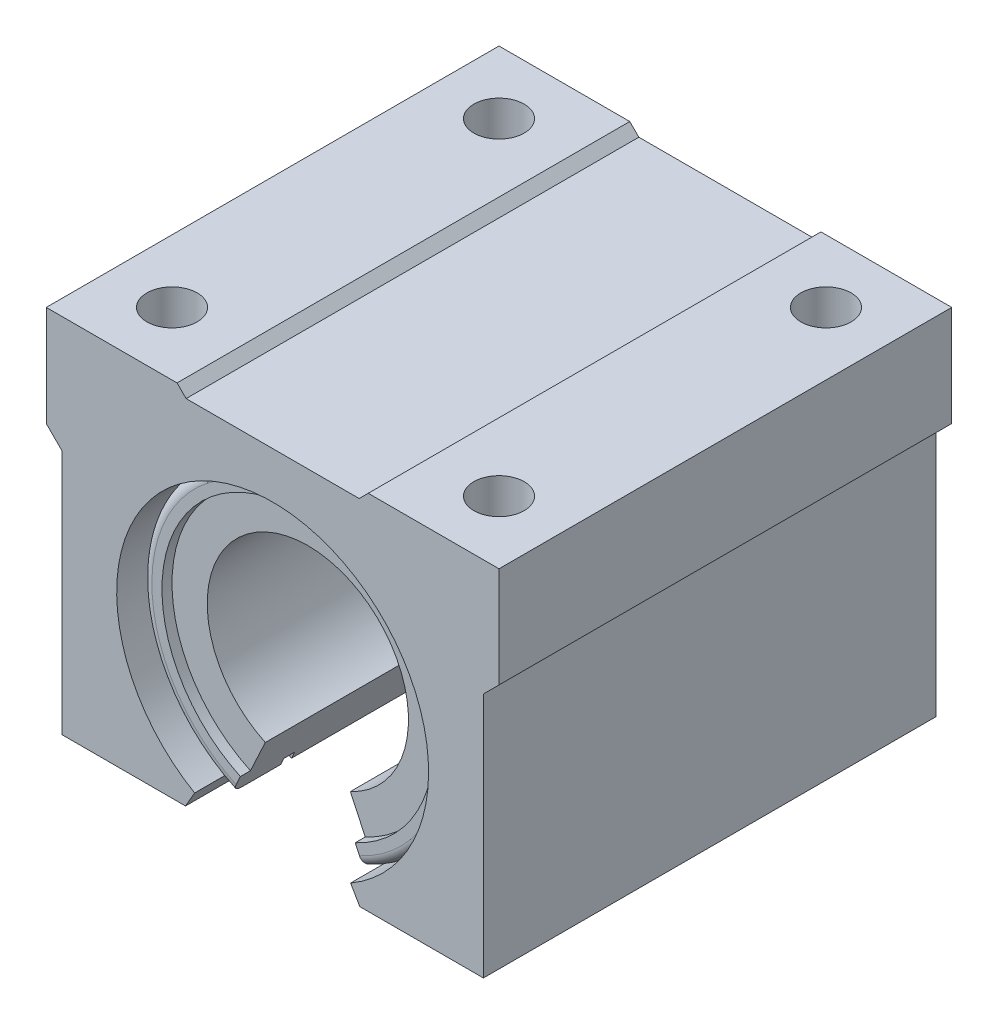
ISO-10303-21;
HEADER;
FILE_DESCRIPTION(('STEP AP214'),'2;1');
FILE_NAME('part.step','',(''),(''),'','','');
FILE_SCHEMA(('AUTOMOTIVE_DESIGN { 1 0 10303 214 1 1 1 1 }'));
ENDSEC;
DATA;
#1=APPLICATION_CONTEXT('core data for automotive mechanical design processes');
#2=APPLICATION_PROTOCOL_DEFINITION('international standard','automotive_design',2000,#1);
#3=PRODUCT_CONTEXT('',#1,'mechanical');
#4=PRODUCT('Part','Part','',(#3));
#5=PRODUCT_RELATED_PRODUCT_CATEGORY('part','',(#4));
#6=PRODUCT_DEFINITION_FORMATION('','',#4);
#7=PRODUCT_DEFINITION_CONTEXT('part definition',#1,'design');
#8=PRODUCT_DEFINITION('design','',#6,#7);
#9=PRODUCT_DEFINITION_SHAPE('','',#8);
#10=(LENGTH_UNIT() NAMED_UNIT(*) SI_UNIT(.MILLI.,.METRE.));
#11=(NAMED_UNIT(*) PLANE_ANGLE_UNIT() SI_UNIT($,.RADIAN.));
#12=(NAMED_UNIT(*) SI_UNIT($,.STERADIAN.) SOLID_ANGLE_UNIT());
#13=UNCERTAINTY_MEASURE_WITH_UNIT(LENGTH_MEASURE(1.E-05),#10,'distance_accuracy_value','');
#14=(GEOMETRIC_REPRESENTATION_CONTEXT(3) GLOBAL_UNCERTAINTY_ASSIGNED_CONTEXT((#13)) GLOBAL_UNIT_ASSIGNED_CONTEXT((#10,
#11,#12)) REPRESENTATION_CONTEXT('',''));
#15=CARTESIAN_POINT('',(0.,0.,0.));
#16=DIRECTION('',(0.,0.,1.));
#17=DIRECTION('',(1.,0.,0.));
#18=AXIS2_PLACEMENT_3D('',#15,#16,#17);
#19=CARTESIAN_POINT('',(0.,0.,40.));
#20=DIRECTION('',(0.,0.,-1.));
#21=DIRECTION('',(-1.,0.,0.));
#22=AXIS2_PLACEMENT_3D('',#19,#20,#21);
#23=CYLINDRICAL_SURFACE('',#22,20.);
#24=DIRECTION('',(0.,0.,-1.));
#25=VECTOR('',#24,1.);
#26=CARTESIAN_POINT('',(8.45236523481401,-18.126155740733,40.));
#27=LINE('',#26,#25);
#28=CARTESIAN_POINT('',(8.45236523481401,-18.126155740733,38.));
#29=VERTEX_POINT('',#28);
#30=CARTESIAN_POINT('',(8.45236523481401,-18.126155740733,-38.));
#31=VERTEX_POINT('',#30);
#32=EDGE_CURVE('P0_E38',#29,#31,#27,.T.);
#33=ORIENTED_EDGE('',*,*,#32,.F.);
#34=CARTESIAN_POINT('',(0.,0.,38.));
#35=DIRECTION('',(0.,0.,1.));
#36=DIRECTION('',(1.,0.,0.));
#37=AXIS2_PLACEMENT_3D('',#34,#35,#36);
#38=CIRCLE('',#37,20.);
#39=CARTESIAN_POINT('',(-8.45236523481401,-18.126155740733,38.));
#40=VERTEX_POINT('',#39);
#41=EDGE_CURVE('P0_E168',#29,#40,#38,.T.);
#42=ORIENTED_EDGE('',*,*,#41,.T.);
#43=DIRECTION('',(0.,0.,-1.));
#44=VECTOR('',#43,1.);
#45=CARTESIAN_POINT('',(-8.45236523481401,-18.126155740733,40.));
#46=LINE('',#45,#44);
#47=CARTESIAN_POINT('',(-8.45236523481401,-18.126155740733,-38.));
#48=VERTEX_POINT('',#47);
#49=EDGE_CURVE('P0_E211',#48,#40,#46,.F.);
#50=ORIENTED_EDGE('',*,*,#49,.F.);
#51=CARTESIAN_POINT('',(0.,0.,-38.));
#52=DIRECTION('',(0.,0.,-1.));
#53=DIRECTION('',(-1.,0.,0.));
#54=AXIS2_PLACEMENT_3D('',#51,#52,#53);
#55=CIRCLE('',#54,20.);
#56=EDGE_CURVE('P0_E166',#48,#31,#55,.T.);
#57=ORIENTED_EDGE('',*,*,#56,.T.);
#58=EDGE_LOOP('',(#33,#42,#50,#57));
#59=FACE_BOUND('',#58,.T.);
#60=ADVANCED_FACE('P0_F16',(#59),#23,.F.);
#61=CARTESIAN_POINT('',(0.,0.,-40.));
#62=DIRECTION('',(0.,0.,1.));
#63=DIRECTION('',(1.,0.,0.));
#64=AXIS2_PLACEMENT_3D('',#61,#62,#63);
#65=PLANE('',#64);
#66=CARTESIAN_POINT('',(0.,0.,-40.));
#67=DIRECTION('',(0.,0.,1.));
#68=DIRECTION('',(1.,0.,0.));
#69=AXIS2_PLACEMENT_3D('',#66,#67,#68);
#70=CIRCLE('',#69,29.);
#71=CARTESIAN_POINT('',(-12.2559295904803,-26.2829258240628,-40.));
#72=VERTEX_POINT('',#71);
#73=CARTESIAN_POINT('',(12.2559295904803,-26.2829258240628,-40.));
#74=VERTEX_POINT('',#73);
#75=EDGE_CURVE('P0_E202',#72,#74,#70,.F.);
#76=ORIENTED_EDGE('',*,*,#75,.T.);
#77=DIRECTION('',(-0.4226182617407,0.90630778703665,0.));
#78=VECTOR('',#77,1.);
#79=CARTESIAN_POINT('',(0.,0.,-40.));
#80=LINE('',#79,#78);
#81=CARTESIAN_POINT('',(11.4106930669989,-24.4703102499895,-40.));
#82=VERTEX_POINT('',#81);
#83=EDGE_CURVE('P0_E159',#74,#82,#80,.T.);
#84=ORIENTED_EDGE('',*,*,#83,.T.);
#85=CARTESIAN_POINT('',(0.,0.,-40.));
#86=DIRECTION('',(0.,0.,1.));
#87=DIRECTION('',(1.,0.,0.));
#88=AXIS2_PLACEMENT_3D('',#85,#86,#87);
#89=CIRCLE('',#88,27.);
#90=CARTESIAN_POINT('',(-11.4106930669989,-24.4703102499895,-40.));
#91=VERTEX_POINT('',#90);
#92=EDGE_CURVE('P0_E228',#82,#91,#89,.T.);
#93=ORIENTED_EDGE('',*,*,#92,.T.);
#94=DIRECTION('',(-0.4226182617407,-0.90630778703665,0.));
#95=VECTOR('',#94,1.);
#96=CARTESIAN_POINT('',(0.,0.,-40.));
#97=LINE('',#96,#95);
#98=EDGE_CURVE('P0_E258',#91,#72,#97,.T.);
#99=ORIENTED_EDGE('',*,*,#98,.T.);
#100=EDGE_LOOP('',(#76,#84,#93,#99));
#101=FACE_BOUND('',#100,.T.);
#102=ADVANCED_FACE('P0_F257',(#101),#65,.F.);
#103=CARTESIAN_POINT('',(0.,0.,40.));
#104=DIRECTION('',(0.,0.,-1.));
#105=DIRECTION('',(-1.,0.,0.));
#106=AXIS2_PLACEMENT_3D('',#103,#104,#105);
#107=CYLINDRICAL_SURFACE('',#106,31.);
#108=CARTESIAN_POINT('',(0.,0.,28.15));
#109=DIRECTION('',(0.,0.,1.));
#110=DIRECTION('',(1.,0.,0.));
#111=AXIS2_PLACEMENT_3D('',#108,#109,#110);
#112=CIRCLE('',#111,31.);
#113=CARTESIAN_POINT('',(13.1011661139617,-28.0955413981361,28.15));
#114=VERTEX_POINT('',#113);
#115=CARTESIAN_POINT('',(-13.1011661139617,-28.0955413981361,28.15));
#116=VERTEX_POINT('',#115);
#117=EDGE_CURVE('P0_E187',#114,#116,#112,.T.);
#118=ORIENTED_EDGE('',*,*,#117,.F.);
#119=DIRECTION('',(0.,0.,1.));
#120=VECTOR('',#119,1.);
#121=CARTESIAN_POINT('',(13.1011661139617,-28.0955413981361,-40.));
#122=LINE('',#121,#120);
#123=CARTESIAN_POINT('',(13.1011661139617,-28.0955413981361,-28.15));
#124=VERTEX_POINT('',#123);
#125=EDGE_CURVE('P0_E268',#124,#114,#122,.T.);
#126=ORIENTED_EDGE('',*,*,#125,.F.);
#127=CARTESIAN_POINT('',(0.,0.,-28.15));
#128=DIRECTION('',(0.,0.,1.));
#129=DIRECTION('',(1.,0.,0.));
#130=AXIS2_PLACEMENT_3D('',#127,#128,#129);
#131=CIRCLE('',#130,31.);
#132=CARTESIAN_POINT('',(-13.1011661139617,-28.0955413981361,-28.15));
#133=VERTEX_POINT('',#132);
#134=EDGE_CURVE('P0_E184',#124,#133,#131,.T.);
#135=ORIENTED_EDGE('',*,*,#134,.T.);
#136=DIRECTION('',(0.,0.,1.));
#137=VECTOR('',#136,1.);
#138=CARTESIAN_POINT('',(-13.1011661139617,-28.0955413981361,-40.));
#139=LINE('',#138,#137);
#140=EDGE_CURVE('P0_E273',#133,#116,#139,.T.);
#141=ORIENTED_EDGE('',*,*,#140,.T.);
#142=EDGE_LOOP('',(#118,#126,#135,#141));
#143=FACE_BOUND('',#142,.T.);
#144=ADVANCED_FACE('P0_F325',(#143),#107,.T.);
#145=CARTESIAN_POINT('',(0.,0.,-30.3));
#146=DIRECTION('',(0.,0.,1.));
#147=DIRECTION('',(1.,0.,0.));
#148=AXIS2_PLACEMENT_3D('',#145,#146,#147);
#149=CIRCLE('',#148,31.);
#150=CARTESIAN_POINT('',(13.1011661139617,-28.0955413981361,-30.3));
#151=VERTEX_POINT('',#150);
#152=CARTESIAN_POINT('',(-13.1011661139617,-28.0955413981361,-30.3));
#153=VERTEX_POINT('',#152);
#154=EDGE_CURVE('P0_E181',#151,#153,#149,.T.);
#155=ORIENTED_EDGE('',*,*,#154,.F.);
#156=CARTESIAN_POINT('',(13.1011661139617,-28.0955413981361,-38.));
#157=VERTEX_POINT('',#156);
#158=EDGE_CURVE('P0_E270',#157,#151,#122,.T.);
#159=ORIENTED_EDGE('',*,*,#158,.F.);
#160=CARTESIAN_POINT('',(0.,0.,-38.));
#161=DIRECTION('',(0.,0.,1.));
#162=DIRECTION('',(1.,0.,0.));
#163=AXIS2_PLACEMENT_3D('',#160,#161,#162);
#164=CIRCLE('',#163,31.);
#165=CARTESIAN_POINT('',(-13.1011661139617,-28.0955413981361,-38.));
#166=VERTEX_POINT('',#165);
#167=EDGE_CURVE('P0_E199',#157,#166,#164,.T.);
#168=ORIENTED_EDGE('',*,*,#167,.T.);
#169=EDGE_CURVE('P0_E269',#166,#153,#139,.T.);
#170=ORIENTED_EDGE('',*,*,#169,.T.);
#171=EDGE_LOOP('',(#155,#159,#168,#170));
#172=FACE_BOUND('',#171,.T.);
#173=ADVANCED_FACE('P0_F333',(#172),#107,.T.);
#174=CARTESIAN_POINT('',(0.,0.,38.));
#175=DIRECTION('',(0.,0.,1.));
#176=DIRECTION('',(1.,0.,0.));
#177=AXIS2_PLACEMENT_3D('',#174,#175,#176);
#178=CIRCLE('',#177,31.);
#179=CARTESIAN_POINT('',(-13.1011661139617,-28.0955413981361,38.));
#180=VERTEX_POINT('',#179);
#181=CARTESIAN_POINT('',(13.1011661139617,-28.0955413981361,38.));
#182=VERTEX_POINT('',#181);
#183=EDGE_CURVE('P0_E206',#180,#182,#178,.F.);
#184=ORIENTED_EDGE('',*,*,#183,.T.);
#185=CARTESIAN_POINT('',(13.1011661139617,-28.0955413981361,30.3));
#186=VERTEX_POINT('',#185);
#187=EDGE_CURVE('P0_E266',#186,#182,#122,.T.);
#188=ORIENTED_EDGE('',*,*,#187,.F.);
#189=CARTESIAN_POINT('',(0.,0.,30.3));
#190=DIRECTION('',(0.,0.,1.));
#191=DIRECTION('',(1.,0.,0.));
#192=AXIS2_PLACEMENT_3D('',#189,#190,#191);
#193=CIRCLE('',#192,31.);
#194=CARTESIAN_POINT('',(-13.1011661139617,-28.0955413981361,30.3));
#195=VERTEX_POINT('',#194);
#196=EDGE_CURVE('P0_E196',#186,#195,#193,.T.);
#197=ORIENTED_EDGE('',*,*,#196,.T.);
#198=EDGE_CURVE('P0_E262',#195,#180,#139,.T.);
#199=ORIENTED_EDGE('',*,*,#198,.T.);
#200=EDGE_LOOP('',(#184,#188,#197,#199));
#201=FACE_BOUND('',#200,.T.);
#202=ADVANCED_FACE('P0_F305',(#201),#107,.T.);
#203=CARTESIAN_POINT('',(0.,0.,40.));
#204=DIRECTION('',(0.,0.,1.));
#205=DIRECTION('',(1.,0.,0.));
#206=AXIS2_PLACEMENT_3D('',#203,#204,#205);
#207=PLANE('',#206);
#208=DIRECTION('',(-0.4226182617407,0.90630778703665,0.));
#209=VECTOR('',#208,1.);
#210=CARTESIAN_POINT('',(0.,0.,40.));
#211=LINE('',#210,#209);
#212=CARTESIAN_POINT('',(12.2559295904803,-26.2829258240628,40.));
#213=VERTEX_POINT('',#212);
#214=CARTESIAN_POINT('',(11.4106930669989,-24.4703102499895,40.));
#215=VERTEX_POINT('',#214);
#216=EDGE_CURVE('P0_E160',#213,#215,#211,.T.);
#217=ORIENTED_EDGE('',*,*,#216,.F.);
#218=CARTESIAN_POINT('',(0.,0.,40.));
#219=DIRECTION('',(0.,0.,1.));
#220=DIRECTION('',(1.,0.,0.));
#221=AXIS2_PLACEMENT_3D('',#218,#219,#220);
#222=CIRCLE('',#221,29.);
#223=CARTESIAN_POINT('',(-12.2559295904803,-26.2829258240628,40.));
#224=VERTEX_POINT('',#223);
#225=EDGE_CURVE('P0_E158',#213,#224,#222,.T.);
#226=ORIENTED_EDGE('',*,*,#225,.T.);
#227=DIRECTION('',(-0.4226182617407,-0.90630778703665,0.));
#228=VECTOR('',#227,1.);
#229=CARTESIAN_POINT('',(0.,0.,40.));
#230=LINE('',#229,#228);
#231=CARTESIAN_POINT('',(-11.4106930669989,-24.4703102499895,40.));
#232=VERTEX_POINT('',#231);
#233=EDGE_CURVE('P0_E141',#232,#224,#230,.T.);
#234=ORIENTED_EDGE('',*,*,#233,.F.);
#235=CARTESIAN_POINT('',(0.,0.,40.));
#236=DIRECTION('',(0.,0.,1.));
#237=DIRECTION('',(1.,0.,0.));
#238=AXIS2_PLACEMENT_3D('',#235,#236,#237);
#239=CIRCLE('',#238,27.);
#240=EDGE_CURVE('P0_E156',#215,#232,#239,.T.);
#241=ORIENTED_EDGE('',*,*,#240,.F.);
#242=EDGE_LOOP('',(#217,#226,#234,#241));
#243=FACE_BOUND('',#242,.T.);
#244=ADVANCED_FACE('P0_F155',(#243),#207,.T.);
#245=CARTESIAN_POINT('',(-2.16471843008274E-13,-31.,30.3));
#246=DIRECTION('',(0.,0.,-1.));
#247=DIRECTION('',(-1.,0.,0.));
#248=AXIS2_PLACEMENT_3D('',#245,#246,#247);
#249=PLANE('',#248);
#250=DIRECTION('',(0.4226182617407,-0.90630778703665,0.));
#251=VECTOR('',#250,1.);
#252=CARTESIAN_POINT('',(11.8736888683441,-25.4632079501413,30.3));
#253=LINE('',#252,#251);
#254=CARTESIAN_POINT('',(12.4672387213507,-26.7360797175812,30.3));
#255=VERTEX_POINT('',#254);
#256=EDGE_CURVE('P0_E253',#255,#186,#253,.T.);
#257=ORIENTED_EDGE('',*,*,#256,.F.);
#258=CARTESIAN_POINT('',(0.,0.,30.3));
#259=DIRECTION('',(0.,0.,1.));
#260=DIRECTION('',(1.,0.,0.));
#261=AXIS2_PLACEMENT_3D('',#258,#259,#260);
#262=CIRCLE('',#261,29.5);
#263=CARTESIAN_POINT('',(-12.4672387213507,-26.7360797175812,30.3));
#264=VERTEX_POINT('',#263);
#265=EDGE_CURVE('P0_E193',#255,#264,#262,.T.);
#266=ORIENTED_EDGE('',*,*,#265,.T.);
#267=DIRECTION('',(0.4226182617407,0.90630778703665,0.));
#268=VECTOR('',#267,1.);
#269=CARTESIAN_POINT('',(-11.8736888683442,-25.4632079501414,30.3));
#270=LINE('',#269,#268);
#271=EDGE_CURVE('P0_E229',#195,#264,#270,.T.);
#272=ORIENTED_EDGE('',*,*,#271,.F.);
#273=ORIENTED_EDGE('',*,*,#196,.F.);
#274=EDGE_LOOP('',(#257,#266,#272,#273));
#275=FACE_BOUND('',#274,.T.);
#276=ADVANCED_FACE('P0_F303',(#275),#249,.T.);
#277=CARTESIAN_POINT('',(0.,0.,0.));
#278=DIRECTION('',(0.,0.,1.));
#279=DIRECTION('',(1.,0.,0.));
#280=AXIS2_PLACEMENT_3D('',#277,#278,#279);
#281=CYLINDRICAL_SURFACE('',#280,29.5);
#282=DIRECTION('',(0.,0.,1.));
#283=VECTOR('',#282,1.);
#284=CARTESIAN_POINT('',(12.4672387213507,-26.7360797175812,0.));
#285=LINE('',#284,#283);
#286=CARTESIAN_POINT('',(12.4672387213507,-26.7360797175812,28.15));
#287=VERTEX_POINT('',#286);
#288=EDGE_CURVE('P0_E251',#287,#255,#285,.T.);
#289=ORIENTED_EDGE('',*,*,#288,.F.);
#290=CARTESIAN_POINT('',(0.,0.,28.15));
#291=DIRECTION('',(0.,0.,1.));
#292=DIRECTION('',(1.,0.,0.));
#293=AXIS2_PLACEMENT_3D('',#290,#291,#292);
#294=CIRCLE('',#293,29.5);
#295=CARTESIAN_POINT('',(-12.4672387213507,-26.7360797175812,28.15));
#296=VERTEX_POINT('',#295);
#297=EDGE_CURVE('P0_E190',#287,#296,#294,.T.);
#298=ORIENTED_EDGE('',*,*,#297,.T.);
#299=DIRECTION('',(0.,0.,1.));
#300=VECTOR('',#299,1.);
#301=CARTESIAN_POINT('',(-12.4672387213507,-26.7360797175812,0.));
#302=LINE('',#301,#300);
#303=EDGE_CURVE('P0_E233',#264,#296,#302,.F.);
#304=ORIENTED_EDGE('',*,*,#303,.F.);
#305=ORIENTED_EDGE('',*,*,#265,.F.);
#306=EDGE_LOOP('',(#289,#298,#304,#305));
#307=FACE_BOUND('',#306,.T.);
#308=ADVANCED_FACE('P0_F298',(#307),#281,.T.);
#309=CARTESIAN_POINT('',(-2.05997398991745E-13,-29.5,28.15));
#310=DIRECTION('',(0.,0.,1.));
#311=DIRECTION('',(1.,0.,0.));
#312=AXIS2_PLACEMENT_3D('',#309,#310,#311);
#313=PLANE('',#312);
#314=DIRECTION('',(-0.4226182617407,0.90630778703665,0.));
#315=VECTOR('',#314,1.);
#316=CARTESIAN_POINT('',(11.2991555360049,-24.2311172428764,28.15));
#317=LINE('',#316,#315);
#318=EDGE_CURVE('P0_E249',#114,#287,#317,.T.);
#319=ORIENTED_EDGE('',*,*,#318,.F.);
#320=ORIENTED_EDGE('',*,*,#117,.T.);
#321=DIRECTION('',(-0.4226182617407,-0.90630778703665,0.));
#322=VECTOR('',#321,1.);
#323=CARTESIAN_POINT('',(-11.299155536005,-24.2311172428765,28.15));
#324=LINE('',#323,#322);
#325=EDGE_CURVE('P0_E285',#296,#116,#324,.T.);
#326=ORIENTED_EDGE('',*,*,#325,.F.);
#327=ORIENTED_EDGE('',*,*,#297,.F.);
#328=EDGE_LOOP('',(#319,#320,#326,#327));
#329=FACE_BOUND('',#328,.T.);
#330=ADVANCED_FACE('P0_F295',(#329),#313,.T.);
#331=CARTESIAN_POINT('',(-2.05997398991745E-13,-29.5,-28.15));
#332=DIRECTION('',(0.,0.,-1.));
#333=DIRECTION('',(-1.,0.,0.));
#334=AXIS2_PLACEMENT_3D('',#331,#332,#333);
#335=PLANE('',#334);
#336=DIRECTION('',(0.4226182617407,-0.90630778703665,0.));
#337=VECTOR('',#336,1.);
#338=CARTESIAN_POINT('',(11.2991555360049,-24.2311172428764,-28.15));
#339=LINE('',#338,#337);
#340=CARTESIAN_POINT('',(12.4672387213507,-26.7360797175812,-28.15));
#341=VERTEX_POINT('',#340);
#342=EDGE_CURVE('P0_E247',#341,#124,#339,.T.);
#343=ORIENTED_EDGE('',*,*,#342,.F.);
#344=CARTESIAN_POINT('',(0.,0.,-28.15));
#345=DIRECTION('',(0.,0.,1.));
#346=DIRECTION('',(1.,0.,0.));
#347=AXIS2_PLACEMENT_3D('',#344,#345,#346);
#348=CIRCLE('',#347,29.5);
#349=CARTESIAN_POINT('',(-12.4672387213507,-26.7360797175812,-28.15));
#350=VERTEX_POINT('',#349);
#351=EDGE_CURVE('P0_E175',#341,#350,#348,.T.);
#352=ORIENTED_EDGE('',*,*,#351,.T.);
#353=DIRECTION('',(0.4226182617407,0.90630778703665,0.));
#354=VECTOR('',#353,1.);
#355=CARTESIAN_POINT('',(-11.299155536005,-24.2311172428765,-28.15));
#356=LINE('',#355,#354);
#357=EDGE_CURVE('P0_E283',#133,#350,#356,.T.);
#358=ORIENTED_EDGE('',*,*,#357,.F.);
#359=ORIENTED_EDGE('',*,*,#134,.F.);
#360=EDGE_LOOP('',(#343,#352,#358,#359));
#361=FACE_BOUND('',#360,.T.);
#362=ADVANCED_FACE('P0_F361',(#361),#335,.T.);
#363=CARTESIAN_POINT('',(-2.16471843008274E-13,-31.,-30.3));
#364=DIRECTION('',(0.,0.,1.));
#365=DIRECTION('',(1.,0.,0.));
#366=AXIS2_PLACEMENT_3D('',#363,#364,#365);
#367=PLANE('',#366);
#368=DIRECTION('',(-0.4226182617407,0.90630778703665,0.));
#369=VECTOR('',#368,1.);
#370=CARTESIAN_POINT('',(11.8736888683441,-25.4632079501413,-30.3));
#371=LINE('',#370,#369);
#372=CARTESIAN_POINT('',(12.4672387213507,-26.7360797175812,-30.3));
#373=VERTEX_POINT('',#372);
#374=EDGE_CURVE('P0_E245',#151,#373,#371,.T.);
#375=ORIENTED_EDGE('',*,*,#374,.F.);
#376=ORIENTED_EDGE('',*,*,#154,.T.);
#377=DIRECTION('',(-0.4226182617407,-0.90630778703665,0.));
#378=VECTOR('',#377,1.);
#379=CARTESIAN_POINT('',(-11.8736888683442,-25.4632079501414,-30.3));
#380=LINE('',#379,#378);
#381=CARTESIAN_POINT('',(-12.4672387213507,-26.7360797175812,-30.3));
#382=VERTEX_POINT('',#381);
#383=EDGE_CURVE('P0_E281',#382,#153,#380,.T.);
#384=ORIENTED_EDGE('',*,*,#383,.F.);
#385=CARTESIAN_POINT('',(0.,0.,-30.3));
#386=DIRECTION('',(0.,0.,1.));
#387=DIRECTION('',(1.,0.,0.));
#388=AXIS2_PLACEMENT_3D('',#385,#386,#387);
#389=CIRCLE('',#388,29.5);
#390=EDGE_CURVE('P0_E178',#373,#382,#389,.T.);
#391=ORIENTED_EDGE('',*,*,#390,.F.);
#392=EDGE_LOOP('',(#375,#376,#384,#391));
#393=FACE_BOUND('',#392,.T.);
#394=ADVANCED_FACE('P0_F353',(#393),#367,.T.);
#395=CARTESIAN_POINT('',(0.,0.,0.));
#396=DIRECTION('',(0.,0.,1.));
#397=DIRECTION('',(1.,0.,0.));
#398=AXIS2_PLACEMENT_3D('',#395,#396,#397);
#399=CYLINDRICAL_SURFACE('',#398,29.5);
#400=DIRECTION('',(0.,0.,1.));
#401=VECTOR('',#400,1.);
#402=CARTESIAN_POINT('',(12.4672387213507,-26.7360797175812,0.));
#403=LINE('',#402,#401);
#404=EDGE_CURVE('P0_E243',#373,#341,#403,.T.);
#405=ORIENTED_EDGE('',*,*,#404,.F.);
#406=ORIENTED_EDGE('',*,*,#390,.T.);
#407=DIRECTION('',(0.,0.,1.));
#408=VECTOR('',#407,1.);
#409=CARTESIAN_POINT('',(-12.4672387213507,-26.7360797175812,0.));
#410=LINE('',#409,#408);
#411=EDGE_CURVE('P0_E279',#350,#382,#410,.F.);
#412=ORIENTED_EDGE('',*,*,#411,.F.);
#413=ORIENTED_EDGE('',*,*,#351,.F.);
#414=EDGE_LOOP('',(#405,#406,#412,#413));
#415=FACE_BOUND('',#414,.T.);
#416=ADVANCED_FACE('P0_F318',(#415),#399,.T.);
#417=CARTESIAN_POINT('',(0.,0.,-38.));
#418=DIRECTION('',(0.,0.,1.));
#419=DIRECTION('',(1.,0.,0.));
#420=AXIS2_PLACEMENT_3D('',#417,#418,#419);
#421=TOROIDAL_SURFACE('',#420,29.,2.);
#422=CARTESIAN_POINT('',(12.2559295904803,-26.2829258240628,-38.));
#423=DIRECTION('',(0.90630778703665,0.4226182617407,0.));
#424=DIRECTION('',(-0.4226182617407,0.90630778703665,0.));
#425=AXIS2_PLACEMENT_3D('',#422,#423,#424);
#426=CIRCLE('',#425,2.);
#427=EDGE_CURVE('P0_E241',#74,#157,#426,.F.);
#428=ORIENTED_EDGE('',*,*,#427,.F.);
#429=ORIENTED_EDGE('',*,*,#75,.F.);
#430=CARTESIAN_POINT('',(-12.2559295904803,-26.2829258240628,-38.));
#431=DIRECTION('',(-0.90630778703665,0.4226182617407,0.));
#432=DIRECTION('',(-0.4226182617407,-0.90630778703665,0.));
#433=AXIS2_PLACEMENT_3D('',#430,#431,#432);
#434=CIRCLE('',#433,2.);
#435=EDGE_CURVE('P0_E277',#166,#72,#434,.F.);
#436=ORIENTED_EDGE('',*,*,#435,.F.);
#437=ORIENTED_EDGE('',*,*,#167,.F.);
#438=EDGE_LOOP('',(#428,#429,#436,#437));
#439=FACE_BOUND('',#438,.T.);
#440=ADVANCED_FACE('P0_F310',(#439),#421,.T.);
#441=CARTESIAN_POINT('',(0.,0.,38.));
#442=DIRECTION('',(0.,0.,1.));
#443=DIRECTION('',(1.,0.,0.));
#444=AXIS2_PLACEMENT_3D('',#441,#442,#443);
#445=TOROIDAL_SURFACE('',#444,29.,2.);
#446=CARTESIAN_POINT('',(12.2559295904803,-26.2829258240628,38.));
#447=DIRECTION('',(0.90630778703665,0.4226182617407,0.));
#448=DIRECTION('',(-0.4226182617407,0.90630778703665,0.));
#449=AXIS2_PLACEMENT_3D('',#446,#447,#448);
#450=CIRCLE('',#449,2.);
#451=EDGE_CURVE('P0_E239',#182,#213,#450,.F.);
#452=ORIENTED_EDGE('',*,*,#451,.F.);
#453=ORIENTED_EDGE('',*,*,#183,.F.);
#454=CARTESIAN_POINT('',(-12.2559295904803,-26.2829258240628,38.));
#455=DIRECTION('',(-0.90630778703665,0.4226182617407,0.));
#456=DIRECTION('',(-0.4226182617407,-0.90630778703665,0.));
#457=AXIS2_PLACEMENT_3D('',#454,#455,#456);
#458=CIRCLE('',#457,2.);
#459=EDGE_CURVE('P0_E149',#224,#180,#458,.F.);
#460=ORIENTED_EDGE('',*,*,#459,.F.);
#461=ORIENTED_EDGE('',*,*,#225,.F.);
#462=EDGE_LOOP('',(#452,#453,#460,#461));
#463=FACE_BOUND('',#462,.T.);
#464=ADVANCED_FACE('P0_F18',(#463),#445,.T.);
#465=CARTESIAN_POINT('',(0.,0.,38.));
#466=DIRECTION('',(0.,0.,1.));
#467=DIRECTION('',(1.,0.,0.));
#468=AXIS2_PLACEMENT_3D('',#465,#466,#467);
#469=CYLINDRICAL_SURFACE('',#468,27.);
#470=CARTESIAN_POINT('',(0.,0.,38.));
#471=DIRECTION('',(0.,0.,1.));
#472=DIRECTION('',(1.,0.,0.));
#473=AXIS2_PLACEMENT_3D('',#470,#471,#472);
#474=CIRCLE('',#473,27.);
#475=CARTESIAN_POINT('',(11.4106930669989,-24.4703102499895,38.));
#476=VERTEX_POINT('',#475);
#477=CARTESIAN_POINT('',(-11.4106930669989,-24.4703102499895,38.));
#478=VERTEX_POINT('',#477);
#479=EDGE_CURVE('P0_E165',#476,#478,#474,.T.);
#480=ORIENTED_EDGE('',*,*,#479,.F.);
#481=DIRECTION('',(0.,0.,1.));
#482=VECTOR('',#481,1.);
#483=CARTESIAN_POINT('',(11.4106930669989,-24.4703102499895,38.));
#484=LINE('',#483,#482);
#485=EDGE_CURVE('P0_E164',#476,#215,#484,.T.);
#486=ORIENTED_EDGE('',*,*,#485,.T.);
#487=ORIENTED_EDGE('',*,*,#240,.T.);
#488=DIRECTION('',(0.,0.,1.));
#489=VECTOR('',#488,1.);
#490=CARTESIAN_POINT('',(-11.4106930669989,-24.4703102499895,38.));
#491=LINE('',#490,#489);
#492=EDGE_CURVE('P0_E138',#232,#478,#491,.F.);
#493=ORIENTED_EDGE('',*,*,#492,.T.);
#494=EDGE_LOOP('',(#480,#486,#487,#493));
#495=FACE_BOUND('',#494,.T.);
#496=ADVANCED_FACE('P0_F163',(#495),#469,.F.);
#497=CARTESIAN_POINT('',(0.,0.,38.));
#498=DIRECTION('',(0.,0.,1.));
#499=DIRECTION('',(1.,0.,0.));
#500=AXIS2_PLACEMENT_3D('',#497,#498,#499);
#501=PLANE('',#500);
#502=DIRECTION('',(-0.4226182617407,0.90630778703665,0.));
#503=VECTOR('',#502,1.);
#504=CARTESIAN_POINT('',(0.,0.,38.));
#505=LINE('',#504,#503);
#506=EDGE_CURVE('P0_E231',#476,#29,#505,.T.);
#507=ORIENTED_EDGE('',*,*,#506,.F.);
#508=ORIENTED_EDGE('',*,*,#479,.T.);
#509=DIRECTION('',(-0.4226182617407,-0.90630778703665,0.));
#510=VECTOR('',#509,1.);
#511=CARTESIAN_POINT('',(0.,0.,38.));
#512=LINE('',#511,#510);
#513=EDGE_CURVE('P0_E144',#40,#478,#512,.T.);
#514=ORIENTED_EDGE('',*,*,#513,.F.);
#515=ORIENTED_EDGE('',*,*,#41,.F.);
#516=EDGE_LOOP('',(#507,#508,#514,#515));
#517=FACE_BOUND('',#516,.T.);
#518=ADVANCED_FACE('P0_F316',(#517),#501,.T.);
#519=CARTESIAN_POINT('',(0.,0.,-38.));
#520=DIRECTION('',(0.,0.,-1.));
#521=DIRECTION('',(-1.,0.,0.));
#522=AXIS2_PLACEMENT_3D('',#519,#520,#521);
#523=CYLINDRICAL_SURFACE('',#522,27.);
#524=DIRECTION('',(0.,0.,-1.));
#525=VECTOR('',#524,1.);
#526=CARTESIAN_POINT('',(11.4106930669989,-24.4703102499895,-38.));
#527=LINE('',#526,#525);
#528=CARTESIAN_POINT('',(11.4106930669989,-24.4703102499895,-38.));
#529=VERTEX_POINT('',#528);
#530=EDGE_CURVE('P0_E222',#529,#82,#527,.T.);
#531=ORIENTED_EDGE('',*,*,#530,.F.);
#532=CARTESIAN_POINT('',(0.,0.,-38.));
#533=DIRECTION('',(0.,0.,1.));
#534=DIRECTION('',(1.,0.,0.));
#535=AXIS2_PLACEMENT_3D('',#532,#533,#534);
#536=CIRCLE('',#535,27.);
#537=CARTESIAN_POINT('',(-11.4106930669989,-24.4703102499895,-38.));
#538=VERTEX_POINT('',#537);
#539=EDGE_CURVE('P0_E171',#529,#538,#536,.T.);
#540=ORIENTED_EDGE('',*,*,#539,.T.);
#541=DIRECTION('',(0.,0.,-1.));
#542=VECTOR('',#541,1.);
#543=CARTESIAN_POINT('',(-11.4106930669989,-24.4703102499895,-38.));
#544=LINE('',#543,#542);
#545=EDGE_CURVE('P0_E31',#91,#538,#544,.F.);
#546=ORIENTED_EDGE('',*,*,#545,.F.);
#547=ORIENTED_EDGE('',*,*,#92,.F.);
#548=EDGE_LOOP('',(#531,#540,#546,#547));
#549=FACE_BOUND('',#548,.T.);
#550=ADVANCED_FACE('P0_F226',(#549),#523,.F.);
#551=CARTESIAN_POINT('',(0.,0.,-38.));
#552=DIRECTION('',(0.,0.,-1.));
#553=DIRECTION('',(1.,0.,0.));
#554=AXIS2_PLACEMENT_3D('',#551,#552,#553);
#555=PLANE('',#554);
#556=DIRECTION('',(0.4226182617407,-0.90630778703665,0.));
#557=VECTOR('',#556,1.);
#558=CARTESIAN_POINT('',(0.,0.,-38.));
#559=LINE('',#558,#557);
#560=EDGE_CURVE('P0_E11',#31,#529,#559,.T.);
#561=ORIENTED_EDGE('',*,*,#560,.F.);
#562=ORIENTED_EDGE('',*,*,#56,.F.);
#563=DIRECTION('',(0.4226182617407,0.90630778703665,0.));
#564=VECTOR('',#563,1.);
#565=CARTESIAN_POINT('',(0.,0.,-38.));
#566=LINE('',#565,#564);
#567=EDGE_CURVE('P0_E24',#538,#48,#566,.T.);
#568=ORIENTED_EDGE('',*,*,#567,.F.);
#569=ORIENTED_EDGE('',*,*,#539,.F.);
#570=EDGE_LOOP('',(#561,#562,#568,#569));
#571=FACE_BOUND('',#570,.T.);
#572=ADVANCED_FACE('P0_F219',(#571),#555,.T.);
#573=CARTESIAN_POINT('',(0.,0.,-40.));
#574=DIRECTION('',(-0.90630778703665,0.4226182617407,0.));
#575=DIRECTION('',(-0.4226182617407,-0.90630778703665,0.));
#576=AXIS2_PLACEMENT_3D('',#573,#574,#575);
#577=PLANE('',#576);
#578=ORIENTED_EDGE('',*,*,#271,.T.);
#579=ORIENTED_EDGE('',*,*,#303,.T.);
#580=ORIENTED_EDGE('',*,*,#325,.T.);
#581=ORIENTED_EDGE('',*,*,#140,.F.);
#582=ORIENTED_EDGE('',*,*,#357,.T.);
#583=ORIENTED_EDGE('',*,*,#411,.T.);
#584=ORIENTED_EDGE('',*,*,#383,.T.);
#585=ORIENTED_EDGE('',*,*,#169,.F.);
#586=ORIENTED_EDGE('',*,*,#435,.T.);
#587=ORIENTED_EDGE('',*,*,#98,.F.);
#588=ORIENTED_EDGE('',*,*,#545,.T.);
#589=ORIENTED_EDGE('',*,*,#567,.T.);
#590=ORIENTED_EDGE('',*,*,#49,.T.);
#591=ORIENTED_EDGE('',*,*,#513,.T.);
#592=ORIENTED_EDGE('',*,*,#492,.F.);
#593=ORIENTED_EDGE('',*,*,#233,.T.);
#594=ORIENTED_EDGE('',*,*,#459,.T.);
#595=ORIENTED_EDGE('',*,*,#198,.F.);
#596=EDGE_LOOP('',(#578,#579,#580,#581,#582,#583,#584,#585,#586,#587,#588,#589,#590,#591,#592,
#593,#594,#595));
#597=FACE_BOUND('',#596,.T.);
#598=ADVANCED_FACE('P0_F140',(#597),#577,.F.);
#599=CARTESIAN_POINT('',(0.,0.,-40.));
#600=DIRECTION('',(0.90630778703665,0.4226182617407,0.));
#601=DIRECTION('',(-0.4226182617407,0.90630778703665,0.));
#602=AXIS2_PLACEMENT_3D('',#599,#600,#601);
#603=PLANE('',#602);
#604=ORIENTED_EDGE('',*,*,#256,.T.);
#605=ORIENTED_EDGE('',*,*,#187,.T.);
#606=ORIENTED_EDGE('',*,*,#451,.T.);
#607=ORIENTED_EDGE('',*,*,#216,.T.);
#608=ORIENTED_EDGE('',*,*,#485,.F.);
#609=ORIENTED_EDGE('',*,*,#506,.T.);
#610=ORIENTED_EDGE('',*,*,#32,.T.);
#611=ORIENTED_EDGE('',*,*,#560,.T.);
#612=ORIENTED_EDGE('',*,*,#530,.T.);
#613=ORIENTED_EDGE('',*,*,#83,.F.);
#614=ORIENTED_EDGE('',*,*,#427,.T.);
#615=ORIENTED_EDGE('',*,*,#158,.T.);
#616=ORIENTED_EDGE('',*,*,#374,.T.);
#617=ORIENTED_EDGE('',*,*,#404,.T.);
#618=ORIENTED_EDGE('',*,*,#342,.T.);
#619=ORIENTED_EDGE('',*,*,#125,.T.);
#620=ORIENTED_EDGE('',*,*,#318,.T.);
#621=ORIENTED_EDGE('',*,*,#288,.T.);
#622=EDGE_LOOP('',(#604,#605,#606,#607,#608,#609,#610,#611,#612,#613,#614,#615,#616,#617,#618,
#619,#620,#621));
#623=FACE_BOUND('',#622,.T.);
#624=ADVANCED_FACE('P0_F221',(#623),#603,.F.);
#625=CLOSED_SHELL('',(#60,#102,#144,#173,#202,#244,#276,#308,#330,#362,#394,#416,#440,#464,#496,
#518,#550,#572,#598,#624));
#626=MANIFOLD_SOLID_BREP('P0_B1',#625);
#627=CARTESIAN_POINT('',(45.,42.,-45.));
#628=DIRECTION('',(0.,1.,0.));
#629=DIRECTION('',(-1.,0.,0.));
#630=AXIS2_PLACEMENT_3D('',#627,#628,#629);
#631=PLANE('',#630);
#632=CARTESIAN_POINT('',(-32.5,42.,-32.5));
#633=DIRECTION('',(0.,1.,0.));
#634=DIRECTION('',(-1.,0.,0.));
#635=AXIS2_PLACEMENT_3D('',#632,#633,#634);
#636=CIRCLE('',#635,5.);
#637=CARTESIAN_POINT('',(-37.5,42.,-32.5));
#638=VERTEX_POINT('',#637);
#639=EDGE_CURVE('P1_E329',#638,#638,#636,.T.);
#640=ORIENTED_EDGE('',*,*,#639,.F.);
#641=EDGE_LOOP('',(#640));
#642=FACE_BOUND('',#641,.T.);
#643=DIRECTION('',(0.,0.,1.));
#644=VECTOR('',#643,1.);
#645=CARTESIAN_POINT('',(-19.,42.,-45.));
#646=LINE('',#645,#644);
#647=CARTESIAN_POINT('',(-19.,42.,-45.));
#648=VERTEX_POINT('',#647);
#649=CARTESIAN_POINT('',(-19.,42.,45.));
#650=VERTEX_POINT('',#649);
#651=EDGE_CURVE('P1_E261',#648,#650,#646,.T.);
#652=ORIENTED_EDGE('',*,*,#651,.F.);
#653=DIRECTION('',(-1.,0.,0.));
#654=VECTOR('',#653,1.);
#655=CARTESIAN_POINT('',(45.,42.,-45.));
#656=LINE('',#655,#654);
#657=CARTESIAN_POINT('',(-45.,42.,-45.));
#658=VERTEX_POINT('',#657);
#659=EDGE_CURVE('P1_E276',#648,#658,#656,.T.);
#660=ORIENTED_EDGE('',*,*,#659,.T.);
#661=DIRECTION('',(0.,0.,1.));
#662=VECTOR('',#661,1.);
#663=CARTESIAN_POINT('',(-45.,42.,-45.));
#664=LINE('',#663,#662);
#665=CARTESIAN_POINT('',(-45.,42.,45.));
#666=VERTEX_POINT('',#665);
#667=EDGE_CURVE('P1_E190',#658,#666,#664,.T.);
#668=ORIENTED_EDGE('',*,*,#667,.T.);
#669=DIRECTION('',(-1.,0.,0.));
#670=VECTOR('',#669,1.);
#671=CARTESIAN_POINT('',(45.,42.,45.));
#672=LINE('',#671,#670);
#673=EDGE_CURVE('P1_E169',#650,#666,#672,.T.);
#674=ORIENTED_EDGE('',*,*,#673,.F.);
#675=EDGE_LOOP('',(#652,#660,#668,#674));
#676=FACE_BOUND('',#675,.T.);
#677=CARTESIAN_POINT('',(-32.5,42.,32.5));
#678=DIRECTION('',(0.,1.,0.));
#679=DIRECTION('',(-1.,0.,0.));
#680=AXIS2_PLACEMENT_3D('',#677,#678,#679);
#681=CIRCLE('',#680,5.);
#682=CARTESIAN_POINT('',(-37.5,42.,32.5));
#683=VERTEX_POINT('',#682);
#684=EDGE_CURVE('P1_E292',#683,#683,#681,.T.);
#685=ORIENTED_EDGE('',*,*,#684,.F.);
#686=EDGE_LOOP('',(#685));
#687=FACE_BOUND('',#686,.T.);
#688=ADVANCED_FACE('P1_F15',(#642,#676,#687),#631,.T.);
#689=CARTESIAN_POINT('',(0.,0.,-45.));
#690=DIRECTION('',(0.,0.,1.));
#691=DIRECTION('',(1.,0.,0.));
#692=AXIS2_PLACEMENT_3D('',#689,#690,#691);
#693=CYLINDRICAL_SURFACE('',#692,31.);
#694=CARTESIAN_POINT('',(0.,0.,45.));
#695=DIRECTION('',(0.,0.,-1.));
#696=DIRECTION('',(1.,0.,0.));
#697=AXIS2_PLACEMENT_3D('',#694,#695,#696);
#698=CIRCLE('',#697,31.);
#699=CARTESIAN_POINT('',(-15.5,-26.8467875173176,45.));
#700=VERTEX_POINT('',#699);
#701=CARTESIAN_POINT('',(15.5,-26.8467875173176,45.));
#702=VERTEX_POINT('',#701);
#703=EDGE_CURVE('P1_E150',#700,#702,#698,.T.);
#704=ORIENTED_EDGE('',*,*,#703,.F.);
#705=DIRECTION('',(0.,0.,1.));
#706=VECTOR('',#705,1.);
#707=CARTESIAN_POINT('',(-15.5,-26.8467875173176,-45.));
#708=LINE('',#707,#706);
#709=CARTESIAN_POINT('',(-15.5,-26.8467875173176,-45.));
#710=VERTEX_POINT('',#709);
#711=EDGE_CURVE('P1_E10',#710,#700,#708,.T.);
#712=ORIENTED_EDGE('',*,*,#711,.F.);
#713=CARTESIAN_POINT('',(0.,0.,-45.));
#714=DIRECTION('',(0.,0.,-1.));
#715=DIRECTION('',(1.,0.,0.));
#716=AXIS2_PLACEMENT_3D('',#713,#714,#715);
#717=CIRCLE('',#716,31.);
#718=CARTESIAN_POINT('',(15.5,-26.8467875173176,-45.));
#719=VERTEX_POINT('',#718);
#720=EDGE_CURVE('P1_E184',#710,#719,#717,.T.);
#721=ORIENTED_EDGE('',*,*,#720,.T.);
#722=DIRECTION('',(0.,0.,1.));
#723=VECTOR('',#722,1.);
#724=CARTESIAN_POINT('',(15.5,-26.8467875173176,-45.));
#725=LINE('',#724,#723);
#726=EDGE_CURVE('P1_E19',#719,#702,#725,.T.);
#727=ORIENTED_EDGE('',*,*,#726,.T.);
#728=EDGE_LOOP('',(#704,#712,#721,#727));
#729=FACE_BOUND('',#728,.T.);
#730=ADVANCED_FACE('P1_F17',(#729),#693,.F.);
#731=CARTESIAN_POINT('',(-15.5,-26.8467875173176,-45.));
#732=DIRECTION('',(0.866025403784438,-0.5,0.));
#733=DIRECTION('',(0.500000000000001,0.866025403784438,0.));
#734=AXIS2_PLACEMENT_3D('',#731,#732,#733);
#735=PLANE('',#734);
#736=DIRECTION('',(0.5,0.866025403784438,0.));
#737=VECTOR('',#736,1.);
#738=CARTESIAN_POINT('',(-15.5,-26.8467875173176,45.));
#739=LINE('',#738,#737);
#740=CARTESIAN_POINT('',(-17.3205080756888,-30.,45.));
#741=VERTEX_POINT('',#740);
#742=EDGE_CURVE('P1_E182',#741,#700,#739,.T.);
#743=ORIENTED_EDGE('',*,*,#742,.F.);
#744=DIRECTION('',(0.,0.,1.));
#745=VECTOR('',#744,1.);
#746=CARTESIAN_POINT('',(-17.3205080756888,-30.,-45.));
#747=LINE('',#746,#745);
#748=CARTESIAN_POINT('',(-17.3205080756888,-30.,-45.));
#749=VERTEX_POINT('',#748);
#750=EDGE_CURVE('P1_E24',#749,#741,#747,.T.);
#751=ORIENTED_EDGE('',*,*,#750,.F.);
#752=DIRECTION('',(0.5,0.866025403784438,0.));
#753=VECTOR('',#752,1.);
#754=CARTESIAN_POINT('',(-15.5,-26.8467875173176,-45.));
#755=LINE('',#754,#753);
#756=EDGE_CURVE('P1_E140',#749,#710,#755,.T.);
#757=ORIENTED_EDGE('',*,*,#756,.T.);
#758=ORIENTED_EDGE('',*,*,#711,.T.);
#759=EDGE_LOOP('',(#743,#751,#757,#758));
#760=FACE_BOUND('',#759,.T.);
#761=ADVANCED_FACE('P1_F205',(#760),#735,.T.);
#762=CARTESIAN_POINT('',(-41.9,-30.,-45.));
#763=DIRECTION('',(0.,-1.,0.));
#764=DIRECTION('',(1.,0.,0.));
#765=AXIS2_PLACEMENT_3D('',#762,#763,#764);
#766=PLANE('',#765);
#767=DIRECTION('',(1.,0.,0.));
#768=VECTOR('',#767,1.);
#769=CARTESIAN_POINT('',(-41.9,-30.,45.));
#770=LINE('',#769,#768);
#771=CARTESIAN_POINT('',(-41.9,-30.,45.));
#772=VERTEX_POINT('',#771);
#773=EDGE_CURVE('P1_E126',#772,#741,#770,.T.);
#774=ORIENTED_EDGE('',*,*,#773,.F.);
#775=DIRECTION('',(0.,0.,1.));
#776=VECTOR('',#775,1.);
#777=CARTESIAN_POINT('',(-41.9,-30.,-45.));
#778=LINE('',#777,#776);
#779=CARTESIAN_POINT('',(-41.9,-30.,-45.));
#780=VERTEX_POINT('',#779);
#781=EDGE_CURVE('P1_E120',#780,#772,#778,.T.);
#782=ORIENTED_EDGE('',*,*,#781,.F.);
#783=DIRECTION('',(1.,0.,0.));
#784=VECTOR('',#783,1.);
#785=CARTESIAN_POINT('',(-41.9,-30.,-45.));
#786=LINE('',#785,#784);
#787=EDGE_CURVE('P1_E123',#780,#749,#786,.T.);
#788=ORIENTED_EDGE('',*,*,#787,.T.);
#789=ORIENTED_EDGE('',*,*,#750,.T.);
#790=EDGE_LOOP('',(#774,#782,#788,#789));
#791=FACE_BOUND('',#790,.T.);
#792=ADVANCED_FACE('P1_F122',(#791),#766,.T.);
#793=CARTESIAN_POINT('',(-41.9,18.9,-45.));
#794=DIRECTION('',(-1.,0.,0.));
#795=DIRECTION('',(0.,-1.,0.));
#796=AXIS2_PLACEMENT_3D('',#793,#794,#795);
#797=PLANE('',#796);
#798=DIRECTION('',(0.,-1.,0.));
#799=VECTOR('',#798,1.);
#800=CARTESIAN_POINT('',(-41.9,18.9,45.));
#801=LINE('',#800,#799);
#802=CARTESIAN_POINT('',(-41.9,18.9,45.));
#803=VERTEX_POINT('',#802);
#804=EDGE_CURVE('P1_E179',#803,#772,#801,.T.);
#805=ORIENTED_EDGE('',*,*,#804,.F.);
#806=DIRECTION('',(0.,0.,1.));
#807=VECTOR('',#806,1.);
#808=CARTESIAN_POINT('',(-41.9,18.9,-45.));
#809=LINE('',#808,#807);
#810=CARTESIAN_POINT('',(-41.9,18.9,-45.));
#811=VERTEX_POINT('',#810);
#812=EDGE_CURVE('P1_E131',#811,#803,#809,.T.);
#813=ORIENTED_EDGE('',*,*,#812,.F.);
#814=DIRECTION('',(0.,-1.,0.));
#815=VECTOR('',#814,1.);
#816=CARTESIAN_POINT('',(-41.9,18.9,-45.));
#817=LINE('',#816,#815);
#818=EDGE_CURVE('P1_E138',#811,#780,#817,.T.);
#819=ORIENTED_EDGE('',*,*,#818,.T.);
#820=ORIENTED_EDGE('',*,*,#781,.T.);
#821=EDGE_LOOP('',(#805,#813,#819,#820));
#822=FACE_BOUND('',#821,.T.);
#823=ADVANCED_FACE('P1_F142',(#822),#797,.T.);
#824=CARTESIAN_POINT('',(-45.,22.,-45.));
#825=DIRECTION('',(-0.707106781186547,-0.707106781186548,0.));
#826=DIRECTION('',(0.707106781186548,-0.707106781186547,0.));
#827=AXIS2_PLACEMENT_3D('',#824,#825,#826);
#828=PLANE('',#827);
#829=DIRECTION('',(0.707106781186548,-0.707106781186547,0.));
#830=VECTOR('',#829,1.);
#831=CARTESIAN_POINT('',(-45.,22.,45.));
#832=LINE('',#831,#830);
#833=CARTESIAN_POINT('',(-45.,22.,45.));
#834=VERTEX_POINT('',#833);
#835=EDGE_CURVE('P1_E176',#834,#803,#832,.T.);
#836=ORIENTED_EDGE('',*,*,#835,.F.);
#837=DIRECTION('',(0.,0.,1.));
#838=VECTOR('',#837,1.);
#839=CARTESIAN_POINT('',(-45.,22.,-45.));
#840=LINE('',#839,#838);
#841=CARTESIAN_POINT('',(-45.,22.,-45.));
#842=VERTEX_POINT('',#841);
#843=EDGE_CURVE('P1_E188',#842,#834,#840,.T.);
#844=ORIENTED_EDGE('',*,*,#843,.F.);
#845=DIRECTION('',(0.707106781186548,-0.707106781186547,0.));
#846=VECTOR('',#845,1.);
#847=CARTESIAN_POINT('',(-45.,22.,-45.));
#848=LINE('',#847,#846);
#849=EDGE_CURVE('P1_E143',#842,#811,#848,.T.);
#850=ORIENTED_EDGE('',*,*,#849,.T.);
#851=ORIENTED_EDGE('',*,*,#812,.T.);
#852=EDGE_LOOP('',(#836,#844,#850,#851));
#853=FACE_BOUND('',#852,.T.);
#854=ADVANCED_FACE('P1_F235',(#853),#828,.T.);
#855=CARTESIAN_POINT('',(-45.,42.,-45.));
#856=DIRECTION('',(-1.,0.,0.));
#857=DIRECTION('',(0.,0.,1.));
#858=AXIS2_PLACEMENT_3D('',#855,#856,#857);
#859=PLANE('',#858);
#860=DIRECTION('',(0.,-1.,0.));
#861=VECTOR('',#860,1.);
#862=CARTESIAN_POINT('',(-45.,42.,45.));
#863=LINE('',#862,#861);
#864=EDGE_CURVE('P1_E173',#666,#834,#863,.T.);
#865=ORIENTED_EDGE('',*,*,#864,.F.);
#866=ORIENTED_EDGE('',*,*,#667,.F.);
#867=DIRECTION('',(0.,-1.,0.));
#868=VECTOR('',#867,1.);
#869=CARTESIAN_POINT('',(-45.,42.,-45.));
#870=LINE('',#869,#868);
#871=EDGE_CURVE('P1_E145',#658,#842,#870,.T.);
#872=ORIENTED_EDGE('',*,*,#871,.T.);
#873=ORIENTED_EDGE('',*,*,#843,.T.);
#874=EDGE_LOOP('',(#865,#866,#872,#873));
#875=FACE_BOUND('',#874,.T.);
#876=ADVANCED_FACE('P1_F227',(#875),#859,.T.);
#877=CARTESIAN_POINT('',(32.5,42.,32.5));
#878=DIRECTION('',(0.,1.,0.));
#879=DIRECTION('',(-1.,0.,0.));
#880=AXIS2_PLACEMENT_3D('',#877,#878,#879);
#881=CIRCLE('',#880,5.);
#882=CARTESIAN_POINT('',(27.5,42.,32.5));
#883=VERTEX_POINT('',#882);
#884=EDGE_CURVE('P1_E240',#883,#883,#881,.T.);
#885=ORIENTED_EDGE('',*,*,#884,.F.);
#886=EDGE_LOOP('',(#885));
#887=FACE_BOUND('',#886,.T.);
#888=CARTESIAN_POINT('',(32.5,42.,-32.5));
#889=DIRECTION('',(0.,1.,0.));
#890=DIRECTION('',(-1.,0.,0.));
#891=AXIS2_PLACEMENT_3D('',#888,#889,#890);
#892=CIRCLE('',#891,5.);
#893=CARTESIAN_POINT('',(27.5,42.,-32.5));
#894=VERTEX_POINT('',#893);
#895=EDGE_CURVE('P1_E244',#894,#894,#892,.T.);
#896=ORIENTED_EDGE('',*,*,#895,.F.);
#897=EDGE_LOOP('',(#896));
#898=FACE_BOUND('',#897,.T.);
#899=DIRECTION('',(0.,0.,1.));
#900=VECTOR('',#899,1.);
#901=CARTESIAN_POINT('',(19.,42.,-45.));
#902=LINE('',#901,#900);
#903=CARTESIAN_POINT('',(19.,42.,-45.));
#904=VERTEX_POINT('',#903);
#905=CARTESIAN_POINT('',(19.,42.,45.));
#906=VERTEX_POINT('',#905);
#907=EDGE_CURVE('P1_E250',#904,#906,#902,.T.);
#908=ORIENTED_EDGE('',*,*,#907,.T.);
#909=CARTESIAN_POINT('',(45.,42.,45.));
#910=VERTEX_POINT('',#909);
#911=EDGE_CURVE('P1_E170',#910,#906,#672,.T.);
#912=ORIENTED_EDGE('',*,*,#911,.F.);
#913=DIRECTION('',(0.,0.,1.));
#914=VECTOR('',#913,1.);
#915=CARTESIAN_POINT('',(45.,42.,-45.));
#916=LINE('',#915,#914);
#917=CARTESIAN_POINT('',(45.,42.,-45.));
#918=VERTEX_POINT('',#917);
#919=EDGE_CURVE('P1_E193',#918,#910,#916,.T.);
#920=ORIENTED_EDGE('',*,*,#919,.F.);
#921=EDGE_CURVE('P1_E253',#918,#904,#656,.T.);
#922=ORIENTED_EDGE('',*,*,#921,.T.);
#923=EDGE_LOOP('',(#908,#912,#920,#922));
#924=FACE_BOUND('',#923,.T.);
#925=ADVANCED_FACE('P1_F218',(#887,#898,#924),#631,.T.);
#926=CARTESIAN_POINT('',(45.,42.,-45.));
#927=DIRECTION('',(1.,0.,0.));
#928=DIRECTION('',(0.,0.,-1.));
#929=AXIS2_PLACEMENT_3D('',#926,#927,#928);
#930=PLANE('',#929);
#931=DIRECTION('',(0.,1.,0.));
#932=VECTOR('',#931,1.);
#933=CARTESIAN_POINT('',(45.,42.,45.));
#934=LINE('',#933,#932);
#935=CARTESIAN_POINT('',(45.,22.,45.));
#936=VERTEX_POINT('',#935);
#937=EDGE_CURVE('P1_E166',#936,#910,#934,.T.);
#938=ORIENTED_EDGE('',*,*,#937,.F.);
#939=DIRECTION('',(0.,0.,1.));
#940=VECTOR('',#939,1.);
#941=CARTESIAN_POINT('',(45.,22.,-45.));
#942=LINE('',#941,#940);
#943=CARTESIAN_POINT('',(45.,22.,-45.));
#944=VERTEX_POINT('',#943);
#945=EDGE_CURVE('P1_E195',#944,#936,#942,.T.);
#946=ORIENTED_EDGE('',*,*,#945,.F.);
#947=DIRECTION('',(0.,1.,0.));
#948=VECTOR('',#947,1.);
#949=CARTESIAN_POINT('',(45.,42.,-45.));
#950=LINE('',#949,#948);
#951=EDGE_CURVE('P1_E271',#944,#918,#950,.T.);
#952=ORIENTED_EDGE('',*,*,#951,.T.);
#953=ORIENTED_EDGE('',*,*,#919,.T.);
#954=EDGE_LOOP('',(#938,#946,#952,#953));
#955=FACE_BOUND('',#954,.T.);
#956=ADVANCED_FACE('P1_F226',(#955),#930,.T.);
#957=CARTESIAN_POINT('',(45.,22.,-45.));
#958=DIRECTION('',(0.707106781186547,-0.707106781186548,0.));
#959=DIRECTION('',(0.707106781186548,0.707106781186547,0.));
#960=AXIS2_PLACEMENT_3D('',#957,#958,#959);
#961=PLANE('',#960);
#962=DIRECTION('',(0.707106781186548,0.707106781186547,0.));
#963=VECTOR('',#962,1.);
#964=CARTESIAN_POINT('',(45.,22.,45.));
#965=LINE('',#964,#963);
#966=CARTESIAN_POINT('',(41.9,18.9,45.));
#967=VERTEX_POINT('',#966);
#968=EDGE_CURVE('P1_E163',#967,#936,#965,.T.);
#969=ORIENTED_EDGE('',*,*,#968,.F.);
#970=DIRECTION('',(0.,0.,1.));
#971=VECTOR('',#970,1.);
#972=CARTESIAN_POINT('',(41.9,18.9,-45.));
#973=LINE('',#972,#971);
#974=CARTESIAN_POINT('',(41.9,18.9,-45.));
#975=VERTEX_POINT('',#974);
#976=EDGE_CURVE('P1_E197',#975,#967,#973,.T.);
#977=ORIENTED_EDGE('',*,*,#976,.F.);
#978=DIRECTION('',(0.707106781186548,0.707106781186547,0.));
#979=VECTOR('',#978,1.);
#980=CARTESIAN_POINT('',(45.,22.,-45.));
#981=LINE('',#980,#979);
#982=EDGE_CURVE('P1_E281',#975,#944,#981,.T.);
#983=ORIENTED_EDGE('',*,*,#982,.T.);
#984=ORIENTED_EDGE('',*,*,#945,.T.);
#985=EDGE_LOOP('',(#969,#977,#983,#984));
#986=FACE_BOUND('',#985,.T.);
#987=ADVANCED_FACE('P1_F233',(#986),#961,.T.);
#988=CARTESIAN_POINT('',(41.9,18.9,-45.));
#989=DIRECTION('',(1.,0.,0.));
#990=DIRECTION('',(0.,0.,-1.));
#991=AXIS2_PLACEMENT_3D('',#988,#989,#990);
#992=PLANE('',#991);
#993=DIRECTION('',(0.,1.,0.));
#994=VECTOR('',#993,1.);
#995=CARTESIAN_POINT('',(41.9,18.9,45.));
#996=LINE('',#995,#994);
#997=CARTESIAN_POINT('',(41.9,-30.,45.));
#998=VERTEX_POINT('',#997);
#999=EDGE_CURVE('P1_E160',#998,#967,#996,.T.);
#1000=ORIENTED_EDGE('',*,*,#999,.F.);
#1001=DIRECTION('',(0.,0.,1.));
#1002=VECTOR('',#1001,1.);
#1003=CARTESIAN_POINT('',(41.9,-30.,-45.));
#1004=LINE('',#1003,#1002);
#1005=CARTESIAN_POINT('',(41.9,-30.,-45.));
#1006=VERTEX_POINT('',#1005);
#1007=EDGE_CURVE('P1_E199',#1006,#998,#1004,.T.);
#1008=ORIENTED_EDGE('',*,*,#1007,.F.);
#1009=DIRECTION('',(0.,1.,0.));
#1010=VECTOR('',#1009,1.);
#1011=CARTESIAN_POINT('',(41.9,18.9,-45.));
#1012=LINE('',#1011,#1010);
#1013=EDGE_CURVE('P1_E283',#1006,#975,#1012,.T.);
#1014=ORIENTED_EDGE('',*,*,#1013,.T.);
#1015=ORIENTED_EDGE('',*,*,#976,.T.);
#1016=EDGE_LOOP('',(#1000,#1008,#1014,#1015));
#1017=FACE_BOUND('',#1016,.T.);
#1018=ADVANCED_FACE('P1_F575',(#1017),#992,.T.);
#1019=CARTESIAN_POINT('',(41.9,-30.,-45.));
#1020=DIRECTION('',(0.,-1.,0.));
#1021=DIRECTION('',(1.,0.,0.));
#1022=AXIS2_PLACEMENT_3D('',#1019,#1020,#1021);
#1023=PLANE('',#1022);
#1024=DIRECTION('',(1.,0.,0.));
#1025=VECTOR('',#1024,1.);
#1026=CARTESIAN_POINT('',(41.9,-30.,45.));
#1027=LINE('',#1026,#1025);
#1028=CARTESIAN_POINT('',(17.3205080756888,-30.,45.));
#1029=VERTEX_POINT('',#1028);
#1030=EDGE_CURVE('P1_E157',#1029,#998,#1027,.T.);
#1031=ORIENTED_EDGE('',*,*,#1030,.F.);
#1032=DIRECTION('',(0.,0.,1.));
#1033=VECTOR('',#1032,1.);
#1034=CARTESIAN_POINT('',(17.3205080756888,-30.,-45.));
#1035=LINE('',#1034,#1033);
#1036=CARTESIAN_POINT('',(17.3205080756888,-30.,-45.));
#1037=VERTEX_POINT('',#1036);
#1038=EDGE_CURVE('P1_E200',#1037,#1029,#1035,.T.);
#1039=ORIENTED_EDGE('',*,*,#1038,.F.);
#1040=DIRECTION('',(1.,0.,0.));
#1041=VECTOR('',#1040,1.);
#1042=CARTESIAN_POINT('',(41.9,-30.,-45.));
#1043=LINE('',#1042,#1041);
#1044=EDGE_CURVE('P1_E286',#1037,#1006,#1043,.T.);
#1045=ORIENTED_EDGE('',*,*,#1044,.T.);
#1046=ORIENTED_EDGE('',*,*,#1007,.T.);
#1047=EDGE_LOOP('',(#1031,#1039,#1045,#1046));
#1048=FACE_BOUND('',#1047,.T.);
#1049=ADVANCED_FACE('P1_F568',(#1048),#1023,.T.);
#1050=CARTESIAN_POINT('',(15.5,-26.8467875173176,-45.));
#1051=DIRECTION('',(-0.866025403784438,-0.5,0.));
#1052=DIRECTION('',(0.500000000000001,-0.866025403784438,0.));
#1053=AXIS2_PLACEMENT_3D('',#1050,#1051,#1052);
#1054=PLANE('',#1053);
#1055=DIRECTION('',(0.5,-0.866025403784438,0.));
#1056=VECTOR('',#1055,1.);
#1057=CARTESIAN_POINT('',(15.5,-26.8467875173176,45.));
#1058=LINE('',#1057,#1056);
#1059=EDGE_CURVE('P1_E153',#702,#1029,#1058,.T.);
#1060=ORIENTED_EDGE('',*,*,#1059,.F.);
#1061=ORIENTED_EDGE('',*,*,#726,.F.);
#1062=DIRECTION('',(0.5,-0.866025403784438,0.));
#1063=VECTOR('',#1062,1.);
#1064=CARTESIAN_POINT('',(15.5,-26.8467875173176,-45.));
#1065=LINE('',#1064,#1063);
#1066=EDGE_CURVE('P1_E289',#719,#1037,#1065,.T.);
#1067=ORIENTED_EDGE('',*,*,#1066,.T.);
#1068=ORIENTED_EDGE('',*,*,#1038,.T.);
#1069=EDGE_LOOP('',(#1060,#1061,#1067,#1068));
#1070=FACE_BOUND('',#1069,.T.);
#1071=ADVANCED_FACE('P1_F202',(#1070),#1054,.T.);
#1072=CARTESIAN_POINT('',(0.,0.,-45.));
#1073=DIRECTION('',(0.,0.,1.));
#1074=DIRECTION('',(1.,0.,0.));
#1075=AXIS2_PLACEMENT_3D('',#1072,#1073,#1074);
#1076=PLANE('',#1075);
#1077=ORIENTED_EDGE('',*,*,#659,.F.);
#1078=DIRECTION('',(0.707106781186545,-0.70710678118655,0.));
#1079=VECTOR('',#1078,1.);
#1080=CARTESIAN_POINT('',(-17.2,40.2,-45.));
#1081=LINE('',#1080,#1079);
#1082=CARTESIAN_POINT('',(-17.2,40.2,-45.));
#1083=VERTEX_POINT('',#1082);
#1084=EDGE_CURVE('P1_E309',#648,#1083,#1081,.T.);
#1085=ORIENTED_EDGE('',*,*,#1084,.T.);
#1086=DIRECTION('',(1.,0.,0.));
#1087=VECTOR('',#1086,1.);
#1088=CARTESIAN_POINT('',(17.2,40.2,-45.));
#1089=LINE('',#1088,#1087);
#1090=CARTESIAN_POINT('',(17.2,40.2,-45.));
#1091=VERTEX_POINT('',#1090);
#1092=EDGE_CURVE('P1_E316',#1083,#1091,#1089,.T.);
#1093=ORIENTED_EDGE('',*,*,#1092,.T.);
#1094=DIRECTION('',(0.707106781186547,0.707106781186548,0.));
#1095=VECTOR('',#1094,1.);
#1096=CARTESIAN_POINT('',(19.,42.,-45.));
#1097=LINE('',#1096,#1095);
#1098=EDGE_CURVE('P1_E275',#1091,#904,#1097,.T.);
#1099=ORIENTED_EDGE('',*,*,#1098,.T.);
#1100=ORIENTED_EDGE('',*,*,#921,.F.);
#1101=ORIENTED_EDGE('',*,*,#951,.F.);
#1102=ORIENTED_EDGE('',*,*,#982,.F.);
#1103=ORIENTED_EDGE('',*,*,#1013,.F.);
#1104=ORIENTED_EDGE('',*,*,#1044,.F.);
#1105=ORIENTED_EDGE('',*,*,#1066,.F.);
#1106=ORIENTED_EDGE('',*,*,#720,.F.);
#1107=ORIENTED_EDGE('',*,*,#756,.F.);
#1108=ORIENTED_EDGE('',*,*,#787,.F.);
#1109=ORIENTED_EDGE('',*,*,#818,.F.);
#1110=ORIENTED_EDGE('',*,*,#849,.F.);
#1111=ORIENTED_EDGE('',*,*,#871,.F.);
#1112=EDGE_LOOP('',(#1077,#1085,#1093,#1099,#1100,#1101,#1102,#1103,#1104,#1105,#1106,#1107,
#1108,#1109,#1110,#1111));
#1113=FACE_BOUND('',#1112,.T.);
#1114=ADVANCED_FACE('P1_F136',(#1113),#1076,.F.);
#1115=CARTESIAN_POINT('',(0.,0.,45.));
#1116=DIRECTION('',(0.,0.,1.));
#1117=DIRECTION('',(1.,0.,0.));
#1118=AXIS2_PLACEMENT_3D('',#1115,#1116,#1117);
#1119=PLANE('',#1118);
#1120=DIRECTION('',(0.707106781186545,-0.70710678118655,0.));
#1121=VECTOR('',#1120,1.);
#1122=CARTESIAN_POINT('',(-17.2,40.2,45.));
#1123=LINE('',#1122,#1121);
#1124=CARTESIAN_POINT('',(-17.2,40.2,45.));
#1125=VERTEX_POINT('',#1124);
#1126=EDGE_CURVE('P1_E32',#650,#1125,#1123,.T.);
#1127=ORIENTED_EDGE('',*,*,#1126,.F.);
#1128=ORIENTED_EDGE('',*,*,#673,.T.);
#1129=ORIENTED_EDGE('',*,*,#864,.T.);
#1130=ORIENTED_EDGE('',*,*,#835,.T.);
#1131=ORIENTED_EDGE('',*,*,#804,.T.);
#1132=ORIENTED_EDGE('',*,*,#773,.T.);
#1133=ORIENTED_EDGE('',*,*,#742,.T.);
#1134=ORIENTED_EDGE('',*,*,#703,.T.);
#1135=ORIENTED_EDGE('',*,*,#1059,.T.);
#1136=ORIENTED_EDGE('',*,*,#1030,.T.);
#1137=ORIENTED_EDGE('',*,*,#999,.T.);
#1138=ORIENTED_EDGE('',*,*,#968,.T.);
#1139=ORIENTED_EDGE('',*,*,#937,.T.);
#1140=ORIENTED_EDGE('',*,*,#911,.T.);
#1141=DIRECTION('',(0.707106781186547,0.707106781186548,0.));
#1142=VECTOR('',#1141,1.);
#1143=CARTESIAN_POINT('',(19.,42.,45.));
#1144=LINE('',#1143,#1142);
#1145=CARTESIAN_POINT('',(17.2,40.2,45.));
#1146=VERTEX_POINT('',#1145);
#1147=EDGE_CURVE('P1_E266',#1146,#906,#1144,.T.);
#1148=ORIENTED_EDGE('',*,*,#1147,.F.);
#1149=DIRECTION('',(1.,0.,0.));
#1150=VECTOR('',#1149,1.);
#1151=CARTESIAN_POINT('',(17.2,40.2,45.));
#1152=LINE('',#1151,#1150);
#1153=EDGE_CURVE('P1_E310',#1125,#1146,#1152,.T.);
#1154=ORIENTED_EDGE('',*,*,#1153,.F.);
#1155=EDGE_LOOP('',(#1127,#1128,#1129,#1130,#1131,#1132,#1133,#1134,#1135,#1136,#1137,#1138,
#1139,#1140,#1148,#1154));
#1156=FACE_BOUND('',#1155,.T.);
#1157=ADVANCED_FACE('P1_F204',(#1156),#1119,.T.);
#1158=CARTESIAN_POINT('',(-32.5,22.,32.5));
#1159=DIRECTION('',(0.,1.,0.));
#1160=DIRECTION('',(-1.,0.,0.));
#1161=AXIS2_PLACEMENT_3D('',#1158,#1159,#1160);
#1162=CYLINDRICAL_SURFACE('',#1161,5.);
#1163=CARTESIAN_POINT('',(-32.5,22.,32.5));
#1164=DIRECTION('',(0.,1.,0.));
#1165=DIRECTION('',(-1.,0.,0.));
#1166=AXIS2_PLACEMENT_3D('',#1163,#1164,#1165);
#1167=CIRCLE('',#1166,5.);
#1168=CARTESIAN_POINT('',(-37.5,22.,32.5));
#1169=VERTEX_POINT('',#1168);
#1170=EDGE_CURVE('P1_E154',#1169,#1169,#1167,.T.);
#1171=ORIENTED_EDGE('',*,*,#1170,.F.);
#1172=EDGE_LOOP('',(#1171));
#1173=FACE_BOUND('',#1172,.T.);
#1174=ORIENTED_EDGE('',*,*,#684,.T.);
#1175=EDGE_LOOP('',(#1174));
#1176=FACE_BOUND('',#1175,.T.);
#1177=ADVANCED_FACE('P1_F424',(#1173,#1176),#1162,.F.);
#1178=CARTESIAN_POINT('',(-32.5,22.,32.5));
#1179=DIRECTION('',(0.,1.,0.));
#1180=DIRECTION('',(-1.,0.,0.));
#1181=AXIS2_PLACEMENT_3D('',#1178,#1179,#1180);
#1182=PLANE('',#1181);
#1183=CARTESIAN_POINT('',(-32.5,22.,32.5));
#1184=DIRECTION('',(0.,1.,0.));
#1185=DIRECTION('',(-1.,0.,0.));
#1186=AXIS2_PLACEMENT_3D('',#1183,#1184,#1185);
#1187=CIRCLE('',#1186,4.25);
#1188=CARTESIAN_POINT('',(-36.75,22.,32.5));
#1189=VERTEX_POINT('',#1188);
#1190=EDGE_CURVE('P1_E295',#1189,#1189,#1187,.T.);
#1191=ORIENTED_EDGE('',*,*,#1190,.F.);
#1192=EDGE_LOOP('',(#1191));
#1193=FACE_BOUND('',#1192,.T.);
#1194=ORIENTED_EDGE('',*,*,#1170,.T.);
#1195=EDGE_LOOP('',(#1194));
#1196=FACE_BOUND('',#1195,.T.);
#1197=ADVANCED_FACE('P1_F420',(#1193,#1196),#1182,.T.);
#1198=CARTESIAN_POINT('',(-32.5,17.,32.5));
#1199=DIRECTION('',(0.,1.,0.));
#1200=DIRECTION('',(-1.,0.,0.));
#1201=AXIS2_PLACEMENT_3D('',#1198,#1199,#1200);
#1202=CYLINDRICAL_SURFACE('',#1201,4.25);
#1203=ORIENTED_EDGE('',*,*,#1190,.T.);
#1204=EDGE_LOOP('',(#1203));
#1205=FACE_BOUND('',#1204,.T.);
#1206=CARTESIAN_POINT('',(-32.5,17.,32.5));
#1207=DIRECTION('',(0.,1.,0.));
#1208=DIRECTION('',(-1.,0.,0.));
#1209=AXIS2_PLACEMENT_3D('',#1206,#1207,#1208);
#1210=CIRCLE('',#1209,4.25);
#1211=CARTESIAN_POINT('',(-36.75,17.,32.5));
#1212=VERTEX_POINT('',#1211);
#1213=EDGE_CURVE('P1_E300',#1212,#1212,#1210,.T.);
#1214=ORIENTED_EDGE('',*,*,#1213,.F.);
#1215=EDGE_LOOP('',(#1214));
#1216=FACE_BOUND('',#1215,.T.);
#1217=ADVANCED_FACE('P1_F416',(#1205,#1216),#1202,.F.);
#1218=CARTESIAN_POINT('',(-32.5,17.,32.5));
#1219=DIRECTION('',(0.,1.,0.));
#1220=DIRECTION('',(-1.,0.,0.));
#1221=AXIS2_PLACEMENT_3D('',#1218,#1219,#1220);
#1222=CONICAL_SURFACE('',#1221,4.25,1.0471975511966);
#1223=CARTESIAN_POINT('',(-32.5,14.5462613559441,32.5));
#1224=VERTEX_POINT('',#1223);
#1225=VERTEX_LOOP('',#1224);
#1226=FACE_BOUND('',#1225,.T.);
#1227=ORIENTED_EDGE('',*,*,#1213,.T.);
#1228=EDGE_LOOP('',(#1227));
#1229=FACE_BOUND('',#1228,.T.);
#1230=ADVANCED_FACE('P1_F413',(#1226,#1229),#1222,.F.);
#1231=CARTESIAN_POINT('',(-17.2,40.2,-45.));
#1232=DIRECTION('',(-0.70710678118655,-0.707106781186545,0.));
#1233=DIRECTION('',(0.707106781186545,-0.70710678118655,0.));
#1234=AXIS2_PLACEMENT_3D('',#1231,#1232,#1233);
#1235=PLANE('',#1234);
#1236=ORIENTED_EDGE('',*,*,#1126,.T.);
#1237=DIRECTION('',(0.,0.,1.));
#1238=VECTOR('',#1237,1.);
#1239=CARTESIAN_POINT('',(-17.2,40.2,-45.));
#1240=LINE('',#1239,#1238);
#1241=EDGE_CURVE('P1_E303',#1083,#1125,#1240,.T.);
#1242=ORIENTED_EDGE('',*,*,#1241,.F.);
#1243=ORIENTED_EDGE('',*,*,#1084,.F.);
#1244=ORIENTED_EDGE('',*,*,#651,.T.);
#1245=EDGE_LOOP('',(#1236,#1242,#1243,#1244));
#1246=FACE_BOUND('',#1245,.T.);
#1247=ADVANCED_FACE('P1_F407',(#1246),#1235,.F.);
#1248=CARTESIAN_POINT('',(19.,42.,-45.));
#1249=DIRECTION('',(0.707106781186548,-0.707106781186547,0.));
#1250=DIRECTION('',(0.707106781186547,0.707106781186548,0.));
#1251=AXIS2_PLACEMENT_3D('',#1248,#1249,#1250);
#1252=PLANE('',#1251);
#1253=ORIENTED_EDGE('',*,*,#1147,.T.);
#1254=ORIENTED_EDGE('',*,*,#907,.F.);
#1255=ORIENTED_EDGE('',*,*,#1098,.F.);
#1256=DIRECTION('',(0.,0.,1.));
#1257=VECTOR('',#1256,1.);
#1258=CARTESIAN_POINT('',(17.2,40.2,-45.));
#1259=LINE('',#1258,#1257);
#1260=EDGE_CURVE('P1_E262',#1091,#1146,#1259,.T.);
#1261=ORIENTED_EDGE('',*,*,#1260,.T.);
#1262=EDGE_LOOP('',(#1253,#1254,#1255,#1261));
#1263=FACE_BOUND('',#1262,.T.);
#1264=ADVANCED_FACE('P1_F404',(#1263),#1252,.F.);
#1265=CARTESIAN_POINT('',(17.2,40.2,-45.));
#1266=DIRECTION('',(0.,-1.,0.));
#1267=DIRECTION('',(1.,0.,0.));
#1268=AXIS2_PLACEMENT_3D('',#1265,#1266,#1267);
#1269=PLANE('',#1268);
#1270=ORIENTED_EDGE('',*,*,#1153,.T.);
#1271=ORIENTED_EDGE('',*,*,#1260,.F.);
#1272=ORIENTED_EDGE('',*,*,#1092,.F.);
#1273=ORIENTED_EDGE('',*,*,#1241,.T.);
#1274=EDGE_LOOP('',(#1270,#1271,#1272,#1273));
#1275=FACE_BOUND('',#1274,.T.);
#1276=ADVANCED_FACE('P1_F402',(#1275),#1269,.F.);
#1277=CARTESIAN_POINT('',(32.5,22.,-32.5));
#1278=DIRECTION('',(0.,1.,0.));
#1279=DIRECTION('',(-1.,0.,0.));
#1280=AXIS2_PLACEMENT_3D('',#1277,#1278,#1279);
#1281=CYLINDRICAL_SURFACE('',#1280,5.);
#1282=CARTESIAN_POINT('',(32.5,22.,-32.5));
#1283=DIRECTION('',(0.,1.,0.));
#1284=DIRECTION('',(-1.,0.,0.));
#1285=AXIS2_PLACEMENT_3D('',#1282,#1283,#1284);
#1286=CIRCLE('',#1285,5.);
#1287=CARTESIAN_POINT('',(27.5,22.,-32.5));
#1288=VERTEX_POINT('',#1287);
#1289=EDGE_CURVE('P1_E321',#1288,#1288,#1286,.T.);
#1290=ORIENTED_EDGE('',*,*,#1289,.F.);
#1291=EDGE_LOOP('',(#1290));
#1292=FACE_BOUND('',#1291,.T.);
#1293=ORIENTED_EDGE('',*,*,#895,.T.);
#1294=EDGE_LOOP('',(#1293));
#1295=FACE_BOUND('',#1294,.T.);
#1296=ADVANCED_FACE('P1_F398',(#1292,#1295),#1281,.F.);
#1297=CARTESIAN_POINT('',(32.5,22.,-32.5));
#1298=DIRECTION('',(0.,1.,0.));
#1299=DIRECTION('',(-1.,0.,0.));
#1300=AXIS2_PLACEMENT_3D('',#1297,#1298,#1299);
#1301=PLANE('',#1300);
#1302=CARTESIAN_POINT('',(32.5,22.,-32.5));
#1303=DIRECTION('',(0.,1.,0.));
#1304=DIRECTION('',(-1.,0.,0.));
#1305=AXIS2_PLACEMENT_3D('',#1302,#1303,#1304);
#1306=CIRCLE('',#1305,4.25);
#1307=CARTESIAN_POINT('',(28.25,22.,-32.5));
#1308=VERTEX_POINT('',#1307);
#1309=EDGE_CURVE('P1_E322',#1308,#1308,#1306,.T.);
#1310=ORIENTED_EDGE('',*,*,#1309,.F.);
#1311=EDGE_LOOP('',(#1310));
#1312=FACE_BOUND('',#1311,.T.);
#1313=ORIENTED_EDGE('',*,*,#1289,.T.);
#1314=EDGE_LOOP('',(#1313));
#1315=FACE_BOUND('',#1314,.T.);
#1316=ADVANCED_FACE('P1_F394',(#1312,#1315),#1301,.T.);
#1317=CARTESIAN_POINT('',(32.5,22.,32.5));
#1318=DIRECTION('',(0.,1.,0.));
#1319=DIRECTION('',(-1.,0.,0.));
#1320=AXIS2_PLACEMENT_3D('',#1317,#1318,#1319);
#1321=CYLINDRICAL_SURFACE('',#1320,5.);
#1322=CARTESIAN_POINT('',(32.5,22.,32.5));
#1323=DIRECTION('',(0.,1.,0.));
#1324=DIRECTION('',(-1.,0.,0.));
#1325=AXIS2_PLACEMENT_3D('',#1322,#1323,#1324);
#1326=CIRCLE('',#1325,5.);
#1327=CARTESIAN_POINT('',(27.5,22.,32.5));
#1328=VERTEX_POINT('',#1327);
#1329=EDGE_CURVE('P1_E326',#1328,#1328,#1326,.T.);
#1330=ORIENTED_EDGE('',*,*,#1329,.F.);
#1331=EDGE_LOOP('',(#1330));
#1332=FACE_BOUND('',#1331,.T.);
#1333=ORIENTED_EDGE('',*,*,#884,.T.);
#1334=EDGE_LOOP('',(#1333));
#1335=FACE_BOUND('',#1334,.T.);
#1336=ADVANCED_FACE('P1_F390',(#1332,#1335),#1321,.F.);
#1337=CARTESIAN_POINT('',(32.5,22.,32.5));
#1338=DIRECTION('',(0.,1.,0.));
#1339=DIRECTION('',(-1.,0.,0.));
#1340=AXIS2_PLACEMENT_3D('',#1337,#1338,#1339);
#1341=PLANE('',#1340);
#1342=CARTESIAN_POINT('',(32.5,22.,32.5));
#1343=DIRECTION('',(0.,1.,0.));
#1344=DIRECTION('',(-1.,0.,0.));
#1345=AXIS2_PLACEMENT_3D('',#1342,#1343,#1344);
#1346=CIRCLE('',#1345,4.25);
#1347=CARTESIAN_POINT('',(28.25,22.,32.5));
#1348=VERTEX_POINT('',#1347);
#1349=EDGE_CURVE('P1_E336',#1348,#1348,#1346,.T.);
#1350=ORIENTED_EDGE('',*,*,#1349,.F.);
#1351=EDGE_LOOP('',(#1350));
#1352=FACE_BOUND('',#1351,.T.);
#1353=ORIENTED_EDGE('',*,*,#1329,.T.);
#1354=EDGE_LOOP('',(#1353));
#1355=FACE_BOUND('',#1354,.T.);
#1356=ADVANCED_FACE('P1_F386',(#1352,#1355),#1341,.T.);
#1357=CARTESIAN_POINT('',(-32.5,22.,-32.5));
#1358=DIRECTION('',(0.,1.,0.));
#1359=DIRECTION('',(-1.,0.,0.));
#1360=AXIS2_PLACEMENT_3D('',#1357,#1358,#1359);
#1361=CYLINDRICAL_SURFACE('',#1360,5.);
#1362=CARTESIAN_POINT('',(-32.5,22.,-32.5));
#1363=DIRECTION('',(0.,1.,0.));
#1364=DIRECTION('',(-1.,0.,0.));
#1365=AXIS2_PLACEMENT_3D('',#1362,#1363,#1364);
#1366=CIRCLE('',#1365,5.);
#1367=CARTESIAN_POINT('',(-37.5,22.,-32.5));
#1368=VERTEX_POINT('',#1367);
#1369=EDGE_CURVE('P1_E314',#1368,#1368,#1366,.T.);
#1370=ORIENTED_EDGE('',*,*,#1369,.F.);
#1371=EDGE_LOOP('',(#1370));
#1372=FACE_BOUND('',#1371,.T.);
#1373=ORIENTED_EDGE('',*,*,#639,.T.);
#1374=EDGE_LOOP('',(#1373));
#1375=FACE_BOUND('',#1374,.T.);
#1376=ADVANCED_FACE('P1_F365',(#1372,#1375),#1361,.F.);
#1377=CARTESIAN_POINT('',(-32.5,22.,-32.5));
#1378=DIRECTION('',(0.,1.,0.));
#1379=DIRECTION('',(-1.,0.,0.));
#1380=AXIS2_PLACEMENT_3D('',#1377,#1378,#1379);
#1381=PLANE('',#1380);
#1382=CARTESIAN_POINT('',(-32.5,22.,-32.5));
#1383=DIRECTION('',(0.,1.,0.));
#1384=DIRECTION('',(-1.,0.,0.));
#1385=AXIS2_PLACEMENT_3D('',#1382,#1383,#1384);
#1386=CIRCLE('',#1385,4.25);
#1387=CARTESIAN_POINT('',(-36.75,22.,-32.5));
#1388=VERTEX_POINT('',#1387);
#1389=EDGE_CURVE('P1_E339',#1388,#1388,#1386,.T.);
#1390=ORIENTED_EDGE('',*,*,#1389,.F.);
#1391=EDGE_LOOP('',(#1390));
#1392=FACE_BOUND('',#1391,.T.);
#1393=ORIENTED_EDGE('',*,*,#1369,.T.);
#1394=EDGE_LOOP('',(#1393));
#1395=FACE_BOUND('',#1394,.T.);
#1396=ADVANCED_FACE('P1_F356',(#1392,#1395),#1381,.T.);
#1397=CARTESIAN_POINT('',(-32.5,17.,-32.5));
#1398=DIRECTION('',(0.,1.,0.));
#1399=DIRECTION('',(-1.,0.,0.));
#1400=AXIS2_PLACEMENT_3D('',#1397,#1398,#1399);
#1401=CYLINDRICAL_SURFACE('',#1400,4.25);
#1402=ORIENTED_EDGE('',*,*,#1389,.T.);
#1403=EDGE_LOOP('',(#1402));
#1404=FACE_BOUND('',#1403,.T.);
#1405=CARTESIAN_POINT('',(-32.5,17.,-32.5));
#1406=DIRECTION('',(0.,1.,0.));
#1407=DIRECTION('',(-1.,0.,0.));
#1408=AXIS2_PLACEMENT_3D('',#1405,#1406,#1407);
#1409=CIRCLE('',#1408,4.25);
#1410=CARTESIAN_POINT('',(-36.75,17.,-32.5));
#1411=VERTEX_POINT('',#1410);
#1412=EDGE_CURVE('P1_E342',#1411,#1411,#1409,.T.);
#1413=ORIENTED_EDGE('',*,*,#1412,.F.);
#1414=EDGE_LOOP('',(#1413));
#1415=FACE_BOUND('',#1414,.T.);
#1416=ADVANCED_FACE('P1_F354',(#1404,#1415),#1401,.F.);
#1417=CARTESIAN_POINT('',(0.,17.,-65.));
#1418=DIRECTION('',(0.,1.,0.));
#1419=DIRECTION('',(-1.,0.,0.));
#1420=AXIS2_PLACEMENT_3D('',#1417,#1418,#1419);
#1421=PLANE('',#1420);
#1422=ORIENTED_EDGE('',*,*,#1412,.T.);
#1423=EDGE_LOOP('',(#1422));
#1424=FACE_BOUND('',#1423,.T.);
#1425=ADVANCED_FACE('P1_F352',(#1424),#1421,.T.);
#1426=CARTESIAN_POINT('',(32.5,17.,32.5));
#1427=DIRECTION('',(0.,1.,0.));
#1428=DIRECTION('',(-1.,0.,0.));
#1429=AXIS2_PLACEMENT_3D('',#1426,#1427,#1428);
#1430=CYLINDRICAL_SURFACE('',#1429,4.25);
#1431=ORIENTED_EDGE('',*,*,#1349,.T.);
#1432=EDGE_LOOP('',(#1431));
#1433=FACE_BOUND('',#1432,.T.);
#1434=CARTESIAN_POINT('',(32.5,17.,32.5));
#1435=DIRECTION('',(0.,1.,0.));
#1436=DIRECTION('',(-1.,0.,0.));
#1437=AXIS2_PLACEMENT_3D('',#1434,#1435,#1436);
#1438=CIRCLE('',#1437,4.25);
#1439=CARTESIAN_POINT('',(28.25,17.,32.5));
#1440=VERTEX_POINT('',#1439);
#1441=EDGE_CURVE('P1_E346',#1440,#1440,#1438,.T.);
#1442=ORIENTED_EDGE('',*,*,#1441,.F.);
#1443=EDGE_LOOP('',(#1442));
#1444=FACE_BOUND('',#1443,.T.);
#1445=ADVANCED_FACE('P1_F363',(#1433,#1444),#1430,.F.);
#1446=CARTESIAN_POINT('',(65.,17.,0.));
#1447=DIRECTION('',(0.,1.,0.));
#1448=DIRECTION('',(-1.,0.,0.));
#1449=AXIS2_PLACEMENT_3D('',#1446,#1447,#1448);
#1450=PLANE('',#1449);
#1451=ORIENTED_EDGE('',*,*,#1441,.T.);
#1452=EDGE_LOOP('',(#1451));
#1453=FACE_BOUND('',#1452,.T.);
#1454=ADVANCED_FACE('P1_F369',(#1453),#1450,.T.);
#1455=CARTESIAN_POINT('',(32.5,17.,-32.5));
#1456=DIRECTION('',(0.,1.,0.));
#1457=DIRECTION('',(-1.,0.,0.));
#1458=AXIS2_PLACEMENT_3D('',#1455,#1456,#1457);
#1459=CYLINDRICAL_SURFACE('',#1458,4.25);
#1460=ORIENTED_EDGE('',*,*,#1309,.T.);
#1461=EDGE_LOOP('',(#1460));
#1462=FACE_BOUND('',#1461,.T.);
#1463=CARTESIAN_POINT('',(32.5,17.,-32.5));
#1464=DIRECTION('',(0.,1.,0.));
#1465=DIRECTION('',(-1.,0.,0.));
#1466=AXIS2_PLACEMENT_3D('',#1463,#1464,#1465);
#1467=CIRCLE('',#1466,4.25);
#1468=CARTESIAN_POINT('',(28.25,17.,-32.5));
#1469=VERTEX_POINT('',#1468);
#1470=EDGE_CURVE('P1_E343',#1469,#1469,#1467,.T.);
#1471=ORIENTED_EDGE('',*,*,#1470,.F.);
#1472=EDGE_LOOP('',(#1471));
#1473=FACE_BOUND('',#1472,.T.);
#1474=ADVANCED_FACE('P1_F372',(#1462,#1473),#1459,.F.);
#1475=CARTESIAN_POINT('',(65.,17.,-65.));
#1476=DIRECTION('',(0.,1.,0.));
#1477=DIRECTION('',(-1.,0.,0.));
#1478=AXIS2_PLACEMENT_3D('',#1475,#1476,#1477);
#1479=PLANE('',#1478);
#1480=ORIENTED_EDGE('',*,*,#1470,.T.);
#1481=EDGE_LOOP('',(#1480));
#1482=FACE_BOUND('',#1481,.T.);
#1483=ADVANCED_FACE('P1_F377',(#1482),#1479,.T.);
#1484=CLOSED_SHELL('',(#688,#730,#761,#792,#823,#854,#876,#925,#956,#987,#1018,#1049,#1071,
#1114,#1157,#1177,#1197,#1217,#1230,#1247,#1264,#1276,#1296,#1316,#1336,#1356,#1376,#1396,#1416,
#1425,#1445,#1454,#1474,#1483));
#1485=MANIFOLD_SOLID_BREP('P1_B1',#1484);
#1486=ADVANCED_BREP_SHAPE_REPRESENTATION('',(#18,#626,#1485),#14);
#1487=SHAPE_DEFINITION_REPRESENTATION(#9,#1486);
ENDSEC;
END-ISO-10303-21;
